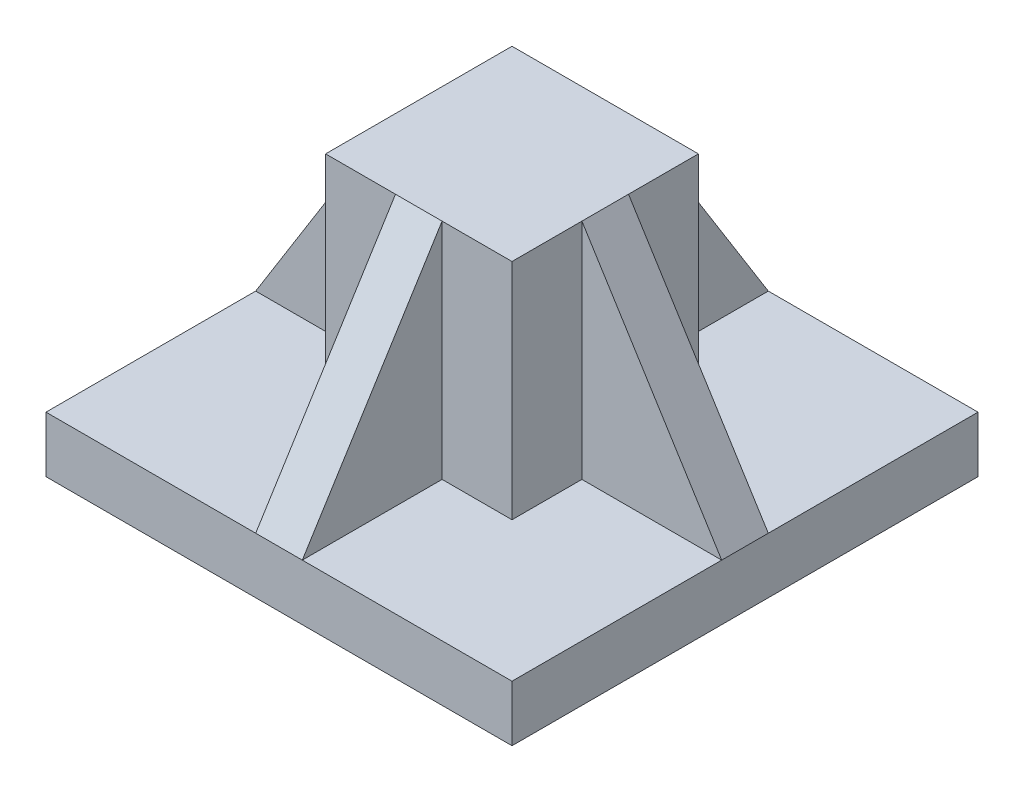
from build123d import *

# Parameters (mm, degrees)
CROQUIS1_W                   = 100
CROQUIS1_H                   = 100
SALIENTE_EXTRUIR1_DEPTH      = 12
CROQUIS2_W                   = 40
CROQUIS2_H                   = 40
SALIENTE_EXTRUIR2_DEPTH      = 60
SALIENTE_EXTRUIR3_DEPTH      = 5
SALIENTE_EXTRUIR3_DEPTH_BACK = 5
SALIENTE_EXTRUIR4_DEPTH      = 5
SALIENTE_EXTRUIR4_DEPTH_BACK = 5


with BuildPart() as part:
    # Croquis1 → Saliente-Extruir1 (new body)
    with BuildSketch(Plane(origin=(0, 0, 0), x_dir=(1, 0, 0), z_dir=(0, 1, 0))):
        Rectangle(CROQUIS1_W, CROQUIS1_H)
    extrude(amount=SALIENTE_EXTRUIR1_DEPTH)

    # Croquis2 → Saliente-Extruir2 (add)
    with BuildSketch(Plane(origin=(0, 0, 0), x_dir=(1, 0, 0), z_dir=(0, 1, 0))):
        Rectangle(CROQUIS2_W, CROQUIS2_H)
    extrude(amount=SALIENTE_EXTRUIR2_DEPTH)

    # Croquis3 → Saliente-Extruir3 (add, two sides: drawn at the far end of the back side and taken through both)
    with BuildSketch(Plane.XY.offset(-SALIENTE_EXTRUIR3_DEPTH_BACK)):
        Polygon((20, 60), (50, 12), (20, 12), align=None)
        Polygon((-20, 60), (-50, 12), (-20, 12), align=None)
    extrude(amount=SALIENTE_EXTRUIR3_DEPTH + SALIENTE_EXTRUIR3_DEPTH_BACK)

    # Croquis4 → Saliente-Extruir4 (add, two sides: drawn at the far end of the back side and taken through both)
    with BuildSketch(Plane(origin=(0, 0, 0), x_dir=(0, 0, -1), z_dir=(1, 0, 0)).offset(-SALIENTE_EXTRUIR4_DEPTH_BACK)):
        Polygon((-50, 12), (-20, 60), (-20, 12), align=None)
        Polygon((20, 60), (50, 12), (20, 12), align=None)
    extrude(amount=SALIENTE_EXTRUIR4_DEPTH + SALIENTE_EXTRUIR4_DEPTH_BACK)


solid = part.part
